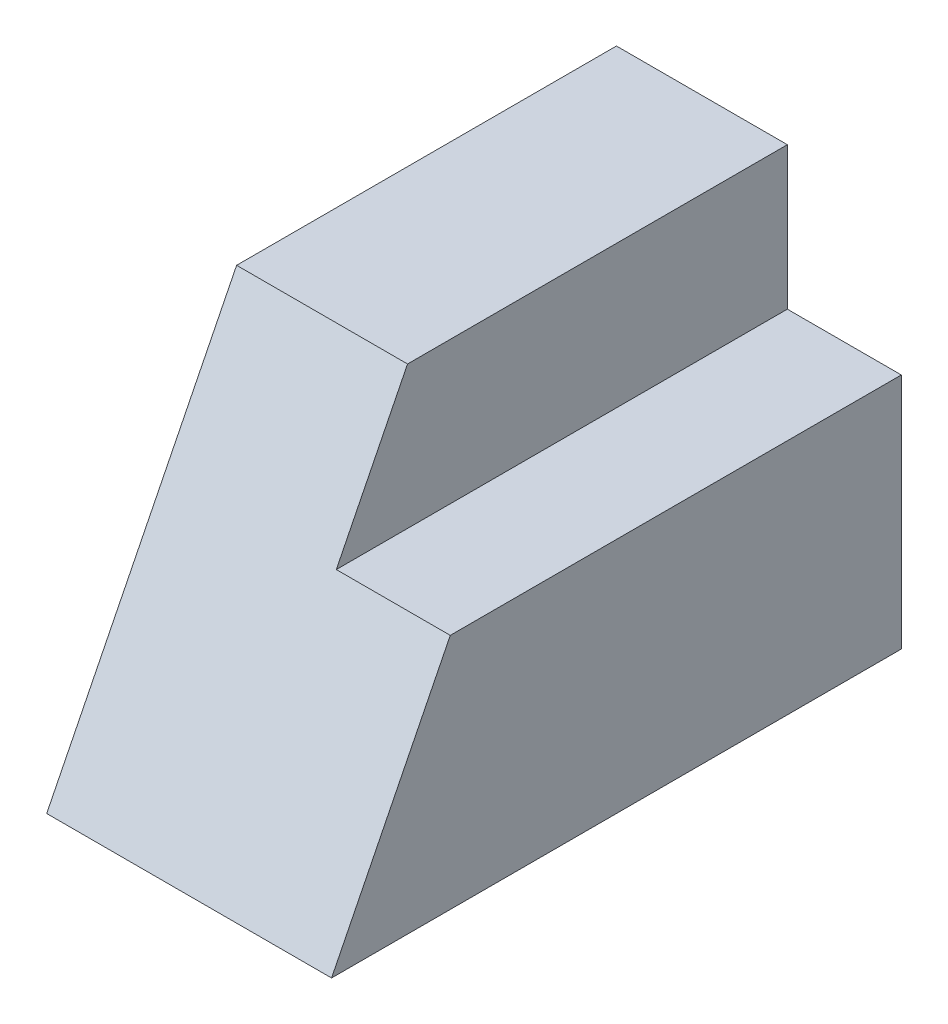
from build123d import *

# Parameters (mm, degrees)
SKETCH_1_W          = 30
SKETCH_1_H          = 60
EXTRUDE_1_DEPTH     = 40
CUT_EXTRUDE_1_DEPTH = 50
SKETCH_3_W          = 12
SKETCH_3_H          = 15
CUT_EXTRUDE_2_DEPTH = 50


with BuildPart() as part:
    # Sketch 1 → Extrude 1 (new body)
    with BuildSketch(Plane(origin=(0, 0, 0), x_dir=(1, 0, 0), z_dir=(0, 1, 0))):
        Rectangle(SKETCH_1_W, SKETCH_1_H)
    extrude(amount=EXTRUDE_1_DEPTH)

    # Sketch 2 → Cut-Extrude 1 (cut)
    with BuildSketch(Plane(origin=(15, 0, 0), x_dir=(0, 0, -1), z_dir=(1, 0, 0))):
        Polygon((-30, 0), (-10, 40), (-30, 40), align=None)
    extrude(amount=-CUT_EXTRUDE_1_DEPTH, mode=Mode.SUBTRACT)

    # Sketch 3 → Cut-Extrude 2 (cut)
    with BuildSketch(Plane(origin=(0, 0, -30), x_dir=(-1, 0, 0), z_dir=(0, 0, -1))):
        with Locations((-9, 32.5)):
            Rectangle(SKETCH_3_W, SKETCH_3_H)
    extrude(amount=-CUT_EXTRUDE_2_DEPTH, mode=Mode.SUBTRACT)


solid = part.part
